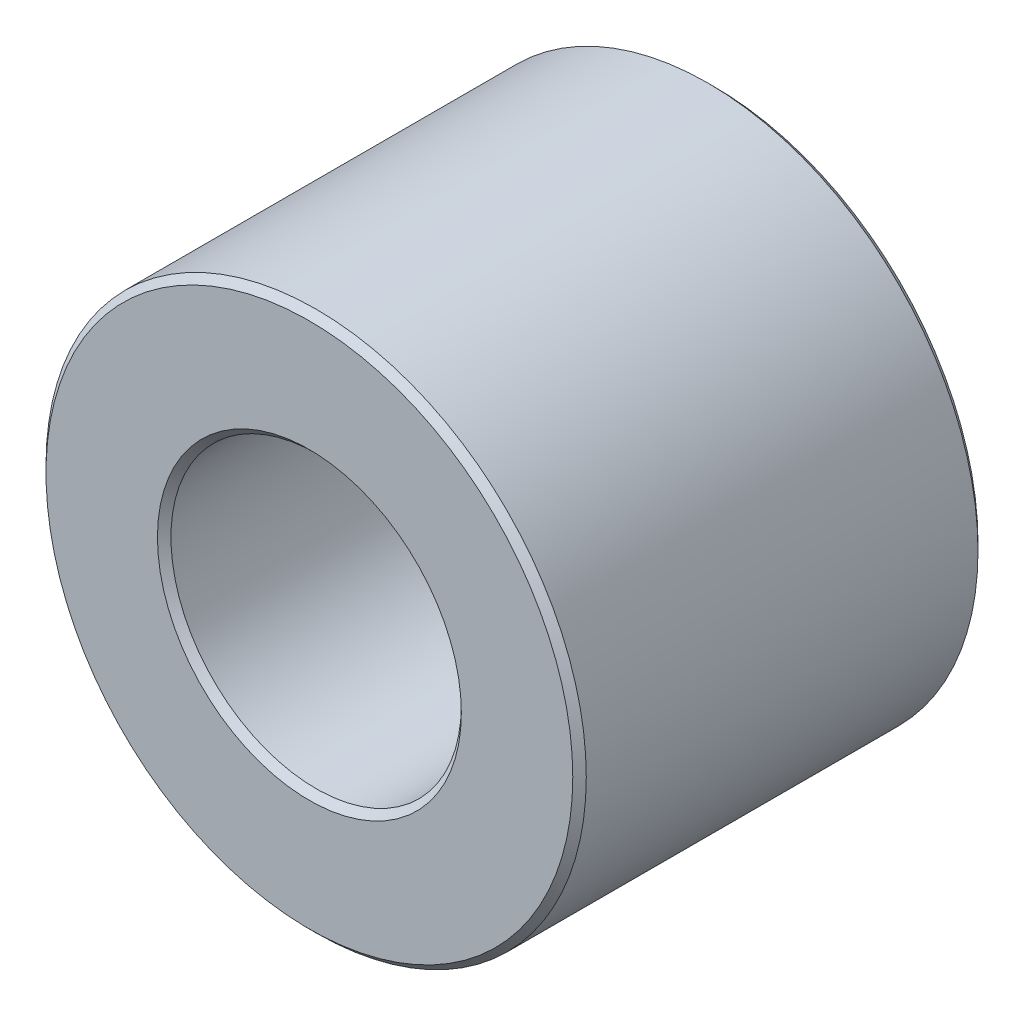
from build123d import *

# Parameters (mm, degrees)
SKETCH1_R           = 4
SKETCH1_R_2         = 2.15
BOSS_EXTRUDE2_DEPTH = 3
CHAMFER3_SIZE       = 0.1


with BuildPart() as part:
    # Sketch1 → Boss-Extrude2 (new, symmetric)
    with BuildSketch(Plane.XY):
        Circle(SKETCH1_R)
        Circle(SKETCH1_R_2, mode=Mode.SUBTRACT)
    extrude(amount=BOSS_EXTRUDE2_DEPTH, both=True)

    # Chamfer3
    chamfer3_edges = [part.edges().sort_by_distance(p)[0] for p in [
        (-4, 0, -3),
        (-4, 0, 3),
        (-2.15, 0, -3),
        (-2.15, 0, 3),
    ]]
    chamfer(chamfer3_edges, length=CHAMFER3_SIZE)


solid = part.part
